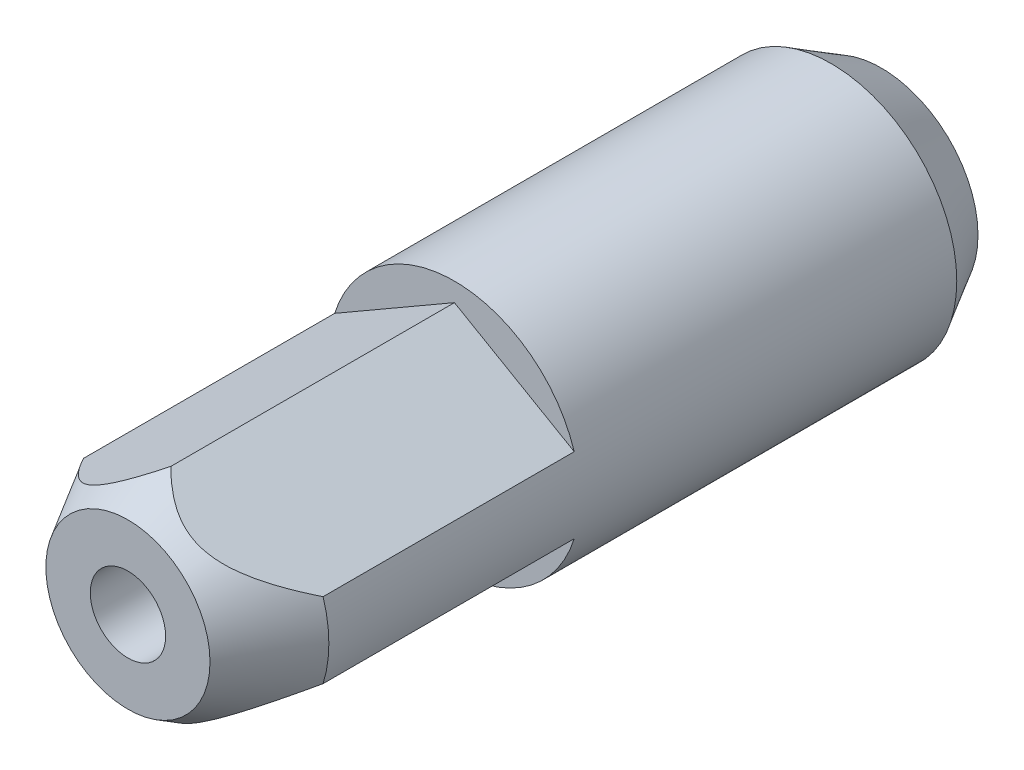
ISO-10303-21;
HEADER;
FILE_DESCRIPTION(('STEP AP214'),'2;1');
FILE_NAME('part.step','',(''),(''),'','','');
FILE_SCHEMA(('AUTOMOTIVE_DESIGN { 1 0 10303 214 1 1 1 1 }'));
ENDSEC;
DATA;
#1=APPLICATION_CONTEXT('core data for automotive mechanical design processes');
#2=APPLICATION_PROTOCOL_DEFINITION('international standard','automotive_design',2000,#1);
#3=PRODUCT_CONTEXT('',#1,'mechanical');
#4=PRODUCT('Part','Part','',(#3));
#5=PRODUCT_RELATED_PRODUCT_CATEGORY('part','',(#4));
#6=PRODUCT_DEFINITION_FORMATION('','',#4);
#7=PRODUCT_DEFINITION_CONTEXT('part definition',#1,'design');
#8=PRODUCT_DEFINITION('design','',#6,#7);
#9=PRODUCT_DEFINITION_SHAPE('','',#8);
#10=(LENGTH_UNIT() NAMED_UNIT(*) SI_UNIT(.MILLI.,.METRE.));
#11=(NAMED_UNIT(*) PLANE_ANGLE_UNIT() SI_UNIT($,.RADIAN.));
#12=(NAMED_UNIT(*) SI_UNIT($,.STERADIAN.) SOLID_ANGLE_UNIT());
#13=UNCERTAINTY_MEASURE_WITH_UNIT(LENGTH_MEASURE(1.E-05),#10,'distance_accuracy_value','');
#14=(GEOMETRIC_REPRESENTATION_CONTEXT(3) GLOBAL_UNCERTAINTY_ASSIGNED_CONTEXT((#13)) GLOBAL_UNIT_ASSIGNED_CONTEXT((#10,
#11,#12)) REPRESENTATION_CONTEXT('',''));
#15=CARTESIAN_POINT('',(0.,0.,0.));
#16=DIRECTION('',(0.,0.,1.));
#17=DIRECTION('',(1.,0.,0.));
#18=AXIS2_PLACEMENT_3D('',#15,#16,#17);
#19=CARTESIAN_POINT('',(0.,0.,27.));
#20=DIRECTION('',(0.,0.,-1.));
#21=DIRECTION('',(-1.,0.,0.));
#22=AXIS2_PLACEMENT_3D('',#19,#20,#21);
#23=CONICAL_SURFACE('',#22,5.,0.523598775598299);
#24=CARTESIAN_POINT('',(0.,0.,30.));
#25=DIRECTION('',(0.,0.,1.));
#26=DIRECTION('',(1.,0.,0.));
#27=AXIS2_PLACEMENT_3D('',#24,#25,#26);
#28=CIRCLE('',#27,3.26794919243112);
#29=CARTESIAN_POINT('',(3.26794919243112,0.,30.));
#30=VERTEX_POINT('',#29);
#31=EDGE_CURVE('E157',#30,#30,#28,.T.);
#32=ORIENTED_EDGE('',*,*,#31,.F.);
#33=EDGE_LOOP('',(#32));
#34=FACE_BOUND('',#33,.T.);
#35=CARTESIAN_POINT('',(-0.000200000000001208,4.2539007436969,28.2922818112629));
#36=CARTESIAN_POINT('',(0.038323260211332,4.23165932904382,28.3308045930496));
#37=CARTESIAN_POINT('',(0.0772314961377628,4.209195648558,28.3688138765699));
#38=CARTESIAN_POINT('',(0.155900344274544,4.16377616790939,28.4436611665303));
#39=CARTESIAN_POINT('',(0.195661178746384,4.14082023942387,28.4804988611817));
#40=CARTESIAN_POINT('',(0.316725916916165,4.07092348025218,28.589376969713));
#41=CARTESIAN_POINT('',(0.399420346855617,4.02317982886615,28.6593859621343));
#42=CARTESIAN_POINT('',(0.57129349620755,3.92394881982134,28.7939882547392));
#43=CARTESIAN_POINT('',(0.660585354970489,3.87239614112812,28.8583915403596));
#44=CARTESIAN_POINT('',(0.843945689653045,3.76653300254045,28.9769188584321));
#45=CARTESIAN_POINT('',(0.938003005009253,3.71222898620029,29.0310656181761));
#46=CARTESIAN_POINT('',(1.13976873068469,3.59573949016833,29.130020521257));
#47=CARTESIAN_POINT('',(1.24795131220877,3.53328024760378,29.1735958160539));
#48=CARTESIAN_POINT('',(1.41329415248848,3.4378195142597,29.2231593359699));
#49=CARTESIAN_POINT('',(1.4687166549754,3.40582131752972,29.237025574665));
#50=CARTESIAN_POINT('',(1.58038760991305,3.34134806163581,29.2591308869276));
#51=CARTESIAN_POINT('',(1.63663566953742,3.30887322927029,29.2673725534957));
#52=CARTESIAN_POINT('',(1.75009913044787,3.24336506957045,29.2779487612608));
#53=CARTESIAN_POINT('',(1.80731862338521,3.21032937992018,29.2802252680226));
#54=CARTESIAN_POINT('',(1.92169033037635,3.14429684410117,29.2786078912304));
#55=CARTESIAN_POINT('',(1.978842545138,3.11129999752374,29.2747140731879));
#56=CARTESIAN_POINT('',(2.09268403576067,3.0455735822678,29.2609098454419));
#57=CARTESIAN_POINT('',(2.14937247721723,3.01284449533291,29.2509903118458));
#58=CARTESIAN_POINT('',(2.26180709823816,2.94793033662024,29.2255298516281));
#59=CARTESIAN_POINT('',(2.31755268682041,2.91574560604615,29.2099855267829));
#60=CARTESIAN_POINT('',(2.51435885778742,2.80211951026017,29.1453717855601));
#61=CARTESIAN_POINT('',(2.65199836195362,2.72265330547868,29.0819760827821));
#62=CARTESIAN_POINT('',(2.8511276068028,2.60768598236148,28.9691954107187));
#63=CARTESIAN_POINT('',(2.91659762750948,2.56988684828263,28.9283995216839));
#64=CARTESIAN_POINT('',(3.04511090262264,2.49568967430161,28.8419756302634));
#65=CARTESIAN_POINT('',(3.10815476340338,2.45929128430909,28.796348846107));
#66=CARTESIAN_POINT('',(3.24864013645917,2.37818201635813,28.6883723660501));
#67=CARTESIAN_POINT('',(3.32538626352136,2.33387261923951,28.6248283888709));
#68=CARTESIAN_POINT('',(3.47569375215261,2.24709255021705,28.4928703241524));
#69=CARTESIAN_POINT('',(3.54925377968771,2.20462264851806,28.4244542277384));
#70=CARTESIAN_POINT('',(3.69378588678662,2.12117699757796,28.28364479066));
#71=CARTESIAN_POINT('',(3.76475040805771,2.08020561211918,28.2112411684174));
#72=CARTESIAN_POINT('',(3.90428118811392,1.99964747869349,28.0634123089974));
#73=CARTESIAN_POINT('',(3.97284718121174,1.96006088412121,27.9879867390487));
#74=CARTESIAN_POINT('',(4.10451079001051,1.88404486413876,27.8385692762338));
#75=CARTESIAN_POINT('',(4.16770996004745,1.84755680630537,27.7646962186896));
#76=CARTESIAN_POINT('',(4.29248993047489,1.77551505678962,27.6151438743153));
#77=CARTESIAN_POINT('',(4.35407061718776,1.73996143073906,27.5394644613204));
#78=CARTESIAN_POINT('',(4.47539394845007,1.66991537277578,27.3871388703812));
#79=CARTESIAN_POINT('',(4.53514639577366,1.63541728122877,27.3105030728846));
#80=CARTESIAN_POINT('',(4.65340823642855,1.5671387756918,27.1559934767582));
#81=CARTESIAN_POINT('',(4.71191791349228,1.53335819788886,27.0781199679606));
#82=CARTESIAN_POINT('',(4.76989600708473,1.49988452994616,26.9997295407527));
#83=B_SPLINE_CURVE_WITH_KNOTS('',3,(#35,#36,#37,#38,#39,#40,#41,#42,#43,#44,#45,#46,#47,#48,#49,
#50,#51,#52,#53,#54,#55,#56,#57,#58,#59,#60,#61,#62,#63,#64,#65,#66,#67,#68,#69,#70,#71,#72,#73,
#74,#75,#76,#77,#78,#79,#80,#81,#82),.UNSPECIFIED.,.F.,.F.,(4,2,2,2,2,2,2,2,2,2,2,2,2,2,2,2,2,2,
2,2,2,2,2,4),(0.,0.176528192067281,0.353102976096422,0.708054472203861,1.07230829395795,
1.4357452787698,1.83100537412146,2.02723914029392,2.22338237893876,2.4214269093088,
2.61946933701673,2.81781238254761,3.01627545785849,3.52623333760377,3.78385768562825,
4.04141722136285,4.36834511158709,4.69540859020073,5.02335892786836,5.3513454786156,
5.66282813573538,5.97433261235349,6.28367121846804,6.59293842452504),.UNSPECIFIED.);
#84=CARTESIAN_POINT('',(0.,4.25378527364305,28.2924818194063));
#85=VERTEX_POINT('',#84);
#86=CARTESIAN_POINT('',(4.76969600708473,1.5,27.));
#87=VERTEX_POINT('',#86);
#88=EDGE_CURVE('E99',#85,#87,#83,.T.);
#89=ORIENTED_EDGE('',*,*,#88,.F.);
#90=CARTESIAN_POINT('',(0.000199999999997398,4.2539007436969,28.2922818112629));
#91=CARTESIAN_POINT('',(-0.0383232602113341,4.23165932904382,28.3308045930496));
#92=CARTESIAN_POINT('',(-0.0772314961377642,4.209195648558,28.3688138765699));
#93=CARTESIAN_POINT('',(-0.155900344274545,4.16377616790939,28.4436611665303));
#94=CARTESIAN_POINT('',(-0.195661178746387,4.14082023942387,28.4804988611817));
#95=CARTESIAN_POINT('',(-0.316725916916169,4.07092348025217,28.589376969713));
#96=CARTESIAN_POINT('',(-0.399420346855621,4.02317982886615,28.6593859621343));
#97=CARTESIAN_POINT('',(-0.571293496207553,3.92394881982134,28.7939882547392));
#98=CARTESIAN_POINT('',(-0.660585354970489,3.87239614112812,28.8583915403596));
#99=CARTESIAN_POINT('',(-0.843945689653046,3.76653300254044,28.9769188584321));
#100=CARTESIAN_POINT('',(-0.938003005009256,3.71222898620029,29.0310656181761));
#101=CARTESIAN_POINT('',(-1.13976873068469,3.59573949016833,29.130020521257));
#102=CARTESIAN_POINT('',(-1.24795131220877,3.53328024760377,29.1735958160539));
#103=CARTESIAN_POINT('',(-1.41329415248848,3.4378195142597,29.2231593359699));
#104=CARTESIAN_POINT('',(-1.4687166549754,3.40582131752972,29.237025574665));
#105=CARTESIAN_POINT('',(-1.58038760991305,3.34134806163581,29.2591308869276));
#106=CARTESIAN_POINT('',(-1.63663566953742,3.30887322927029,29.2673725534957));
#107=CARTESIAN_POINT('',(-1.75009913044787,3.24336506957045,29.2779487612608));
#108=CARTESIAN_POINT('',(-1.80731862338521,3.21032937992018,29.2802252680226));
#109=CARTESIAN_POINT('',(-1.92169033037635,3.14429684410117,29.2786078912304));
#110=CARTESIAN_POINT('',(-1.97884254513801,3.11129999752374,29.2747140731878));
#111=CARTESIAN_POINT('',(-2.09268403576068,3.04557358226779,29.2609098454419));
#112=CARTESIAN_POINT('',(-2.14937247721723,3.01284449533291,29.2509903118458));
#113=CARTESIAN_POINT('',(-2.26180709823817,2.94793033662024,29.2255298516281));
#114=CARTESIAN_POINT('',(-2.31755268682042,2.91574560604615,29.2099855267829));
#115=CARTESIAN_POINT('',(-2.51435885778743,2.80211951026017,29.1453717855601));
#116=CARTESIAN_POINT('',(-2.65199836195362,2.72265330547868,29.0819760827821));
#117=CARTESIAN_POINT('',(-2.8511276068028,2.60768598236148,28.9691954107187));
#118=CARTESIAN_POINT('',(-2.91659762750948,2.56988684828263,28.9283995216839));
#119=CARTESIAN_POINT('',(-3.04511090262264,2.49568967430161,28.8419756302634));
#120=CARTESIAN_POINT('',(-3.10815476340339,2.45929128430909,28.796348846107));
#121=CARTESIAN_POINT('',(-3.24864013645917,2.37818201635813,28.6883723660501));
#122=CARTESIAN_POINT('',(-3.32538626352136,2.33387261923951,28.6248283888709));
#123=CARTESIAN_POINT('',(-3.47569375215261,2.24709255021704,28.4928703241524));
#124=CARTESIAN_POINT('',(-3.54925377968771,2.20462264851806,28.4244542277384));
#125=CARTESIAN_POINT('',(-3.69378588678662,2.12117699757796,28.28364479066));
#126=CARTESIAN_POINT('',(-3.76475040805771,2.08020561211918,28.2112411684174));
#127=CARTESIAN_POINT('',(-3.90428118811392,1.99964747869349,28.0634123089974));
#128=CARTESIAN_POINT('',(-3.97284718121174,1.96006088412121,27.9879867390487));
#129=CARTESIAN_POINT('',(-4.10451079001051,1.88404486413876,27.8385692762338));
#130=CARTESIAN_POINT('',(-4.16770996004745,1.84755680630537,27.7646962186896));
#131=CARTESIAN_POINT('',(-4.29248993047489,1.77551505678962,27.6151438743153));
#132=CARTESIAN_POINT('',(-4.35407061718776,1.73996143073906,27.5394644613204));
#133=CARTESIAN_POINT('',(-4.47539394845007,1.66991537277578,27.3871388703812));
#134=CARTESIAN_POINT('',(-4.53514639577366,1.63541728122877,27.3105030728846));
#135=CARTESIAN_POINT('',(-4.65340823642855,1.5671387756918,27.1559934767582));
#136=CARTESIAN_POINT('',(-4.71191791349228,1.53335819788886,27.0781199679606));
#137=CARTESIAN_POINT('',(-4.76989600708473,1.49988452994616,26.9997295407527));
#138=B_SPLINE_CURVE_WITH_KNOTS('',3,(#90,#91,#92,#93,#94,#95,#96,#97,#98,#99,#100,#101,#102,
#103,#104,#105,#106,#107,#108,#109,#110,#111,#112,#113,#114,#115,#116,#117,#118,#119,#120,#121,
#122,#123,#124,#125,#126,#127,#128,#129,#130,#131,#132,#133,#134,#135,#136,#137),.UNSPECIFIED.,
.F.,.F.,(4,2,2,2,2,2,2,2,2,2,2,2,2,2,2,2,2,2,2,2,2,2,2,4),(0.,0.176528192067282,
0.353102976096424,0.708054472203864,1.07230829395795,1.4357452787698,1.83100537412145,
2.02723914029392,2.22338237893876,2.42142690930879,2.61946933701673,2.81781238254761,
3.0162754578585,3.52623333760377,3.78385768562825,4.04141722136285,4.36834511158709,
4.69540859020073,5.02335892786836,5.3513454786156,5.66282813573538,5.97433261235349,
6.28367121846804,6.59293842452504),.UNSPECIFIED.);
#139=CARTESIAN_POINT('',(-4.76969600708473,1.5,27.));
#140=VERTEX_POINT('',#139);
#141=EDGE_CURVE('E74',#85,#140,#138,.T.);
#142=ORIENTED_EDGE('',*,*,#141,.T.);
#143=CARTESIAN_POINT('',(0.,0.,27.));
#144=DIRECTION('',(0.,0.,1.));
#145=DIRECTION('',(1.,0.,0.));
#146=AXIS2_PLACEMENT_3D('',#143,#144,#145);
#147=CIRCLE('',#146,5.);
#148=CARTESIAN_POINT('',(-4.76969600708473,-1.5,27.));
#149=VERTEX_POINT('',#148);
#150=EDGE_CURVE('E153',#140,#149,#147,.T.);
#151=ORIENTED_EDGE('',*,*,#150,.T.);
#152=CARTESIAN_POINT('',(0.0001999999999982,-4.25390074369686,28.292281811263));
#153=CARTESIAN_POINT('',(-0.0383232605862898,-4.23165932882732,28.3308045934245));
#154=CARTESIAN_POINT('',(-0.0772314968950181,-4.20919564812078,28.3688138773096));
#155=CARTESIAN_POINT('',(-0.155900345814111,-4.16377616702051,28.4436611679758));
#156=CARTESIAN_POINT('',(-0.195661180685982,-4.14082023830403,28.4804988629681));
#157=CARTESIAN_POINT('',(-0.31672592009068,-4.07092347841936,28.5893769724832));
#158=CARTESIAN_POINT('',(-0.399420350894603,-4.02317982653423,28.6593859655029));
#159=CARTESIAN_POINT('',(-0.571293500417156,-3.92394881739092,28.7939882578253));
#160=CARTESIAN_POINT('',(-0.66058535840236,-3.87239613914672,28.858391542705));
#161=CARTESIAN_POINT('',(-0.84394569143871,-3.76653300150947,28.9769188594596));
#162=CARTESIAN_POINT('',(-0.938003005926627,-3.71222898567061,29.0310656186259));
#163=CARTESIAN_POINT('',(-1.13976873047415,-3.59573949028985,29.130020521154));
#164=CARTESIAN_POINT('',(-1.2479513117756,-3.53328024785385,29.1735958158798));
#165=CARTESIAN_POINT('',(-1.41329415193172,-3.43781951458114,29.2231593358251));
#166=CARTESIAN_POINT('',(-1.46871665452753,-3.40582131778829,29.2370255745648));
#167=CARTESIAN_POINT('',(-1.58038760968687,-3.34134806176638,29.2591308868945));
#168=CARTESIAN_POINT('',(-1.63663566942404,-3.30887322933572,29.2673725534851));
#169=CARTESIAN_POINT('',(-1.75009913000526,-3.24336506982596,29.2779487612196));
#170=CARTESIAN_POINT('',(-1.80731862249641,-3.21032938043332,29.2802252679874));
#171=CARTESIAN_POINT('',(-1.92169032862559,-3.14429684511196,29.2786078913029));
#172=CARTESIAN_POINT('',(-1.97884254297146,-3.11129999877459,29.2747140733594));
#173=CARTESIAN_POINT('',(-2.09268403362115,-3.04557358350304,29.2609098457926));
#174=CARTESIAN_POINT('',(-2.1493724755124,-3.01284449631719,29.2509903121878));
#175=CARTESIAN_POINT('',(-2.26180709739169,-2.94793033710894,29.2255298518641));
#176=CARTESIAN_POINT('',(-2.3175526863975,-2.9157456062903,29.2099855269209));
#177=CARTESIAN_POINT('',(-2.51435886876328,-2.80211950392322,29.1453717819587));
#178=CARTESIAN_POINT('',(-2.65199838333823,-2.72265329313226,29.0819760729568));
#179=CARTESIAN_POINT('',(-2.85112763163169,-2.60768596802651,28.9691953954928));
#180=CARTESIAN_POINT('',(-2.9165976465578,-2.56988683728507,28.9283995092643));
#181=CARTESIAN_POINT('',(-3.04511091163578,-2.49568966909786,28.8419756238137));
#182=CARTESIAN_POINT('',(-3.10815476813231,-2.45929128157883,28.7963488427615));
#183=CARTESIAN_POINT('',(-3.24863718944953,-2.37818371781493,28.6883746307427));
#184=CARTESIAN_POINT('',(-3.32538050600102,-2.33387594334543,28.6248331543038));
#185=CARTESIAN_POINT('',(-3.47568259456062,-2.24709899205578,28.4928804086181));
#186=CARTESIAN_POINT('',(-3.54924003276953,-2.20463058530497,28.4244671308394));
#187=CARTESIAN_POINT('',(-3.69376711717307,-2.12118783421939,28.2836635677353));
#188=CARTESIAN_POINT('',(-3.76472920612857,-2.08021785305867,28.2112630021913));
#189=CARTESIAN_POINT('',(-3.90425526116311,-1.99966244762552,28.0634404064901));
#190=CARTESIAN_POINT('',(-3.97281896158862,-1.96007717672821,27.9880180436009));
#191=CARTESIAN_POINT('',(-4.10447837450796,-1.88406357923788,27.8386067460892));
#192=CARTESIAN_POINT('',(-4.16767563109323,-1.84757662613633,27.7647366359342));
#193=CARTESIAN_POINT('',(-4.29245184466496,-1.77553704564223,27.6151902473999));
#194=CARTESIAN_POINT('',(-4.35403068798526,-1.73998448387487,27.5395138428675));
#195=CARTESIAN_POINT('',(-4.47535043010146,-1.66994049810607,27.3871942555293));
#196=CARTESIAN_POINT('',(-4.53510113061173,-1.63544341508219,27.3105614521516));
#197=CARTESIAN_POINT('',(-4.65335952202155,-1.56716690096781,27.156057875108));
#198=CARTESIAN_POINT('',(-4.7118674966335,-1.53338730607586,27.0781873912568));
#199=CARTESIAN_POINT('',(-4.76984390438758,-1.49991461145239,26.9998));
#200=B_SPLINE_CURVE_WITH_KNOTS('',3,(#152,#153,#154,#155,#156,#157,#158,#159,#160,#161,#162,
#163,#164,#165,#166,#167,#168,#169,#170,#171,#172,#173,#174,#175,#176,#177,#178,#179,#180,#181,
#182,#183,#184,#185,#186,#187,#188,#189,#190,#191,#192,#193,#194,#195,#196,#197,#198,#199),
.UNSPECIFIED.,.F.,.F.,(4,2,2,2,2,2,2,2,2,2,2,2,2,2,2,2,2,2,2,2,2,2,2,4),(0.,0.176528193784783,
0.353102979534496,0.708054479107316,1.07230829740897,1.43574527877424,1.83100537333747,
2.02723913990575,2.22338237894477,2.42142690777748,2.61946933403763,2.81781238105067,
3.01627545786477,3.52623337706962,3.78385770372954,4.04141722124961,4.36833285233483,
4.69538405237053,5.02332201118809,5.35129617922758,5.66276788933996,5.97426141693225,
6.28358929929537,6.59284578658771),.UNSPECIFIED.);
#201=CARTESIAN_POINT('',(0.,-4.25378527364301,28.2924818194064));
#202=VERTEX_POINT('',#201);
#203=EDGE_CURVE('E127',#202,#149,#200,.T.);
#204=ORIENTED_EDGE('',*,*,#203,.F.);
#205=CARTESIAN_POINT('',(-0.000200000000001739,-4.25390074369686,28.292281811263));
#206=CARTESIAN_POINT('',(0.0383232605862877,-4.23165932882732,28.3308045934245));
#207=CARTESIAN_POINT('',(0.0772314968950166,-4.20919564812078,28.3688138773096));
#208=CARTESIAN_POINT('',(0.155900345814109,-4.16377616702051,28.4436611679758));
#209=CARTESIAN_POINT('',(0.195661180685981,-4.14082023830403,28.4804988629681));
#210=CARTESIAN_POINT('',(0.316725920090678,-4.07092347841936,28.5893769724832));
#211=CARTESIAN_POINT('',(0.399420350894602,-4.02317982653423,28.6593859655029));
#212=CARTESIAN_POINT('',(0.571293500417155,-3.92394881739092,28.7939882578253));
#213=CARTESIAN_POINT('',(0.660585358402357,-3.87239613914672,28.858391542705));
#214=CARTESIAN_POINT('',(0.843945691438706,-3.76653300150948,28.9769188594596));
#215=CARTESIAN_POINT('',(0.938003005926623,-3.71222898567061,29.0310656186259));
#216=CARTESIAN_POINT('',(1.13976873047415,-3.59573949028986,29.130020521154));
#217=CARTESIAN_POINT('',(1.24795131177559,-3.53328024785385,29.1735958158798));
#218=CARTESIAN_POINT('',(1.41329415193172,-3.43781951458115,29.2231593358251));
#219=CARTESIAN_POINT('',(1.46871665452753,-3.40582131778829,29.2370255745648));
#220=CARTESIAN_POINT('',(1.58038760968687,-3.34134806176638,29.2591308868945));
#221=CARTESIAN_POINT('',(1.63663566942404,-3.30887322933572,29.2673725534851));
#222=CARTESIAN_POINT('',(1.75009913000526,-3.24336506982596,29.2779487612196));
#223=CARTESIAN_POINT('',(1.80731862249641,-3.21032938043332,29.2802252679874));
#224=CARTESIAN_POINT('',(1.92169032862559,-3.14429684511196,29.2786078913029));
#225=CARTESIAN_POINT('',(1.97884254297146,-3.11129999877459,29.2747140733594));
#226=CARTESIAN_POINT('',(2.09268403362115,-3.04557358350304,29.2609098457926));
#227=CARTESIAN_POINT('',(2.1493724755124,-3.01284449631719,29.2509903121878));
#228=CARTESIAN_POINT('',(2.2618070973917,-2.94793033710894,29.2255298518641));
#229=CARTESIAN_POINT('',(2.3175526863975,-2.9157456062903,29.209985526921));
#230=CARTESIAN_POINT('',(2.51435886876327,-2.80211950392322,29.1453717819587));
#231=CARTESIAN_POINT('',(2.65199838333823,-2.72265329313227,29.0819760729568));
#232=CARTESIAN_POINT('',(2.85112763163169,-2.60768596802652,28.9691953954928));
#233=CARTESIAN_POINT('',(2.9165976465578,-2.56988683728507,28.9283995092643));
#234=CARTESIAN_POINT('',(3.04511091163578,-2.49568966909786,28.8419756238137));
#235=CARTESIAN_POINT('',(3.10815476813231,-2.45929128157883,28.7963488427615));
#236=CARTESIAN_POINT('',(3.24863718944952,-2.37818371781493,28.6883746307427));
#237=CARTESIAN_POINT('',(3.32538050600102,-2.33387594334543,28.6248331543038));
#238=CARTESIAN_POINT('',(3.47568259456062,-2.24709899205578,28.4928804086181));
#239=CARTESIAN_POINT('',(3.54924003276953,-2.20463058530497,28.4244671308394));
#240=CARTESIAN_POINT('',(3.69376711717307,-2.12118783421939,28.2836635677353));
#241=CARTESIAN_POINT('',(3.76472920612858,-2.08021785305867,28.2112630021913));
#242=CARTESIAN_POINT('',(3.90425526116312,-1.99966244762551,28.0634404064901));
#243=CARTESIAN_POINT('',(3.97281896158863,-1.96007717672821,27.9880180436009));
#244=CARTESIAN_POINT('',(4.10447837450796,-1.88406357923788,27.8386067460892));
#245=CARTESIAN_POINT('',(4.16767563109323,-1.84757662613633,27.7647366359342));
#246=CARTESIAN_POINT('',(4.29245184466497,-1.77553704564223,27.6151902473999));
#247=CARTESIAN_POINT('',(4.35403068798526,-1.73998448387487,27.5395138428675));
#248=CARTESIAN_POINT('',(4.47535043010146,-1.66994049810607,27.3871942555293));
#249=CARTESIAN_POINT('',(4.53510113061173,-1.63544341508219,27.3105614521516));
#250=CARTESIAN_POINT('',(4.65335952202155,-1.56716690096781,27.156057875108));
#251=CARTESIAN_POINT('',(4.7118674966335,-1.53338730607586,27.0781873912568));
#252=CARTESIAN_POINT('',(4.76984390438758,-1.49991461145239,26.9998));
#253=B_SPLINE_CURVE_WITH_KNOTS('',3,(#205,#206,#207,#208,#209,#210,#211,#212,#213,#214,#215,
#216,#217,#218,#219,#220,#221,#222,#223,#224,#225,#226,#227,#228,#229,#230,#231,#232,#233,#234,
#235,#236,#237,#238,#239,#240,#241,#242,#243,#244,#245,#246,#247,#248,#249,#250,#251,#252),
.UNSPECIFIED.,.F.,.F.,(4,2,2,2,2,2,2,2,2,2,2,2,2,2,2,2,2,2,2,2,2,2,2,4),(0.,0.176528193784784,
0.353102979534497,0.708054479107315,1.07230829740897,1.43574527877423,1.83100537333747,
2.02723913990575,2.22338237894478,2.42142690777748,2.61946933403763,2.81781238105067,
3.01627545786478,3.52623337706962,3.78385770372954,4.04141722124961,4.36833285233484,
4.69538405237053,5.0233220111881,5.35129617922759,5.66276788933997,5.97426141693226,
6.28358929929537,6.59284578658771),.UNSPECIFIED.);
#254=CARTESIAN_POINT('',(4.76969600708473,-1.5,27.));
#255=VERTEX_POINT('',#254);
#256=EDGE_CURVE('E136',#202,#255,#253,.T.);
#257=ORIENTED_EDGE('',*,*,#256,.T.);
#258=EDGE_CURVE('E154',#255,#87,#147,.T.);
#259=ORIENTED_EDGE('',*,*,#258,.T.);
#260=EDGE_LOOP('',(#89,#142,#151,#204,#257,#259));
#261=FACE_BOUND('',#260,.T.);
#262=ADVANCED_FACE('F14',(#34,#261),#23,.T.);
#263=CARTESIAN_POINT('',(0.,0.,30.));
#264=DIRECTION('',(0.,0.,1.));
#265=DIRECTION('',(1.,0.,0.));
#266=AXIS2_PLACEMENT_3D('',#263,#264,#265);
#267=CYLINDRICAL_SURFACE('',#266,5.);
#268=CARTESIAN_POINT('',(0.,0.,2.));
#269=DIRECTION('',(0.,0.,1.));
#270=DIRECTION('',(1.,0.,0.));
#271=AXIS2_PLACEMENT_3D('',#268,#269,#270);
#272=CIRCLE('',#271,5.);
#273=CARTESIAN_POINT('',(5.,0.,2.));
#274=VERTEX_POINT('',#273);
#275=EDGE_CURVE('E150',#274,#274,#272,.T.);
#276=ORIENTED_EDGE('',*,*,#275,.T.);
#277=EDGE_LOOP('',(#276));
#278=FACE_BOUND('',#277,.T.);
#279=DIRECTION('',(0.,0.,1.));
#280=VECTOR('',#279,1.);
#281=CARTESIAN_POINT('',(4.76969600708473,1.5,17.));
#282=LINE('',#281,#280);
#283=CARTESIAN_POINT('',(4.76969600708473,1.5,17.));
#284=VERTEX_POINT('',#283);
#285=EDGE_CURVE('E81',#284,#87,#282,.T.);
#286=ORIENTED_EDGE('',*,*,#285,.T.);
#287=ORIENTED_EDGE('',*,*,#258,.F.);
#288=DIRECTION('',(0.,0.,1.));
#289=VECTOR('',#288,1.);
#290=CARTESIAN_POINT('',(4.76969600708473,-1.5,17.));
#291=LINE('',#290,#289);
#292=CARTESIAN_POINT('',(4.76969600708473,-1.5,17.));
#293=VERTEX_POINT('',#292);
#294=EDGE_CURVE('E186',#293,#255,#291,.T.);
#295=ORIENTED_EDGE('',*,*,#294,.F.);
#296=CARTESIAN_POINT('',(0.,0.,17.));
#297=DIRECTION('',(0.,0.,1.));
#298=DIRECTION('',(1.,0.,0.));
#299=AXIS2_PLACEMENT_3D('',#296,#297,#298);
#300=CIRCLE('',#299,5.);
#301=CARTESIAN_POINT('',(-4.76969600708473,-1.5,17.));
#302=VERTEX_POINT('',#301);
#303=EDGE_CURVE('E176',#302,#293,#300,.T.);
#304=ORIENTED_EDGE('',*,*,#303,.F.);
#305=DIRECTION('',(0.,0.,1.));
#306=VECTOR('',#305,1.);
#307=CARTESIAN_POINT('',(-4.76969600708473,-1.5,17.));
#308=LINE('',#307,#306);
#309=EDGE_CURVE('E183',#302,#149,#308,.T.);
#310=ORIENTED_EDGE('',*,*,#309,.T.);
#311=ORIENTED_EDGE('',*,*,#150,.F.);
#312=DIRECTION('',(0.,0.,1.));
#313=VECTOR('',#312,1.);
#314=CARTESIAN_POINT('',(-4.76969600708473,1.5,17.));
#315=LINE('',#314,#313);
#316=CARTESIAN_POINT('',(-4.76969600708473,1.5,17.));
#317=VERTEX_POINT('',#316);
#318=EDGE_CURVE('E77',#317,#140,#315,.T.);
#319=ORIENTED_EDGE('',*,*,#318,.F.);
#320=CARTESIAN_POINT('',(0.,0.,17.));
#321=DIRECTION('',(0.,0.,1.));
#322=DIRECTION('',(1.,0.,0.));
#323=AXIS2_PLACEMENT_3D('',#320,#321,#322);
#324=CIRCLE('',#323,5.);
#325=EDGE_CURVE('E85',#284,#317,#324,.T.);
#326=ORIENTED_EDGE('',*,*,#325,.F.);
#327=EDGE_LOOP('',(#286,#287,#295,#304,#310,#311,#319,#326));
#328=FACE_BOUND('',#327,.T.);
#329=ADVANCED_FACE('F172',(#278,#328),#267,.T.);
#330=CARTESIAN_POINT('',(0.,0.,22.));
#331=DIRECTION('',(0.,0.,1.));
#332=DIRECTION('',(1.,0.,0.));
#333=AXIS2_PLACEMENT_3D('',#330,#331,#332);
#334=PLANE('',#333);
#335=CARTESIAN_POINT('',(0.,0.,22.));
#336=DIRECTION('',(0.,0.,1.));
#337=DIRECTION('',(1.,0.,0.));
#338=AXIS2_PLACEMENT_3D('',#335,#336,#337);
#339=CIRCLE('',#338,1.5);
#340=CARTESIAN_POINT('',(1.5,0.,22.));
#341=VERTEX_POINT('',#340);
#342=EDGE_CURVE('E9',#341,#341,#339,.T.);
#343=ORIENTED_EDGE('',*,*,#342,.T.);
#344=EDGE_LOOP('',(#343));
#345=FACE_BOUND('',#344,.T.);
#346=ADVANCED_FACE('F16',(#345),#334,.T.);
#347=CARTESIAN_POINT('',(0.,0.,30.));
#348=DIRECTION('',(0.,0.,1.));
#349=DIRECTION('',(1.,0.,0.));
#350=AXIS2_PLACEMENT_3D('',#347,#348,#349);
#351=CYLINDRICAL_SURFACE('',#350,1.5);
#352=ORIENTED_EDGE('',*,*,#342,.F.);
#353=EDGE_LOOP('',(#352));
#354=FACE_BOUND('',#353,.T.);
#355=CARTESIAN_POINT('',(0.,0.,30.));
#356=DIRECTION('',(0.,0.,1.));
#357=DIRECTION('',(1.,0.,0.));
#358=AXIS2_PLACEMENT_3D('',#355,#356,#357);
#359=CIRCLE('',#358,1.5);
#360=CARTESIAN_POINT('',(1.5,0.,30.));
#361=VERTEX_POINT('',#360);
#362=EDGE_CURVE('E22',#361,#361,#359,.T.);
#363=ORIENTED_EDGE('',*,*,#362,.T.);
#364=EDGE_LOOP('',(#363));
#365=FACE_BOUND('',#364,.T.);
#366=ADVANCED_FACE('F162',(#354,#365),#351,.F.);
#367=CARTESIAN_POINT('',(3.26794919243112,0.,30.));
#368=DIRECTION('',(0.,0.,-1.));
#369=DIRECTION('',(-1.,0.,0.));
#370=AXIS2_PLACEMENT_3D('',#367,#368,#369);
#371=PLANE('',#370);
#372=ORIENTED_EDGE('',*,*,#362,.F.);
#373=EDGE_LOOP('',(#372));
#374=FACE_BOUND('',#373,.T.);
#375=ORIENTED_EDGE('',*,*,#31,.T.);
#376=EDGE_LOOP('',(#375));
#377=FACE_BOUND('',#376,.T.);
#378=ADVANCED_FACE('F164',(#374,#377),#371,.F.);
#379=CARTESIAN_POINT('',(0.,0.,0.));
#380=DIRECTION('',(0.,0.,1.));
#381=DIRECTION('',(1.,0.,0.));
#382=AXIS2_PLACEMENT_3D('',#379,#380,#381);
#383=CONICAL_SURFACE('',#382,3.84529946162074,0.523598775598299);
#384=ORIENTED_EDGE('',*,*,#275,.F.);
#385=EDGE_LOOP('',(#384));
#386=FACE_BOUND('',#385,.T.);
#387=CARTESIAN_POINT('',(0.,0.,0.));
#388=DIRECTION('',(0.,0.,1.));
#389=DIRECTION('',(1.,0.,0.));
#390=AXIS2_PLACEMENT_3D('',#387,#388,#389);
#391=CIRCLE('',#390,3.84529946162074);
#392=CARTESIAN_POINT('',(3.84529946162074,0.,0.));
#393=VERTEX_POINT('',#392);
#394=EDGE_CURVE('E147',#393,#393,#391,.T.);
#395=ORIENTED_EDGE('',*,*,#394,.T.);
#396=EDGE_LOOP('',(#395));
#397=FACE_BOUND('',#396,.T.);
#398=ADVANCED_FACE('F167',(#386,#397),#383,.T.);
#399=CARTESIAN_POINT('',(1.,0.,0.));
#400=DIRECTION('',(0.,0.,1.));
#401=DIRECTION('',(1.,0.,0.));
#402=AXIS2_PLACEMENT_3D('',#399,#400,#401);
#403=PLANE('',#402);
#404=ORIENTED_EDGE('',*,*,#394,.F.);
#405=EDGE_LOOP('',(#404));
#406=FACE_BOUND('',#405,.T.);
#407=CARTESIAN_POINT('',(0.,0.,0.));
#408=DIRECTION('',(0.,0.,1.));
#409=DIRECTION('',(1.,0.,0.));
#410=AXIS2_PLACEMENT_3D('',#407,#408,#409);
#411=CIRCLE('',#410,1.);
#412=CARTESIAN_POINT('',(1.,0.,0.));
#413=VERTEX_POINT('',#412);
#414=EDGE_CURVE('E144',#413,#413,#411,.T.);
#415=ORIENTED_EDGE('',*,*,#414,.T.);
#416=EDGE_LOOP('',(#415));
#417=FACE_BOUND('',#416,.T.);
#418=ADVANCED_FACE('F247',(#406,#417),#403,.F.);
#419=CARTESIAN_POINT('',(0.,0.,30.));
#420=DIRECTION('',(0.,0.,1.));
#421=DIRECTION('',(1.,0.,0.));
#422=AXIS2_PLACEMENT_3D('',#419,#420,#421);
#423=CYLINDRICAL_SURFACE('',#422,1.);
#424=ORIENTED_EDGE('',*,*,#414,.F.);
#425=EDGE_LOOP('',(#424));
#426=FACE_BOUND('',#425,.T.);
#427=CARTESIAN_POINT('',(0.,0.,4.));
#428=DIRECTION('',(0.,0.,1.));
#429=DIRECTION('',(1.,0.,0.));
#430=AXIS2_PLACEMENT_3D('',#427,#428,#429);
#431=CIRCLE('',#430,1.);
#432=CARTESIAN_POINT('',(1.,0.,4.));
#433=VERTEX_POINT('',#432);
#434=EDGE_CURVE('E135',#433,#433,#431,.T.);
#435=ORIENTED_EDGE('',*,*,#434,.T.);
#436=EDGE_LOOP('',(#435));
#437=FACE_BOUND('',#436,.T.);
#438=ADVANCED_FACE('F237',(#426,#437),#423,.F.);
#439=CARTESIAN_POINT('',(0.,0.,4.));
#440=DIRECTION('',(0.,0.,1.));
#441=DIRECTION('',(1.,0.,0.));
#442=AXIS2_PLACEMENT_3D('',#439,#440,#441);
#443=PLANE('',#442);
#444=ORIENTED_EDGE('',*,*,#434,.F.);
#445=EDGE_LOOP('',(#444));
#446=FACE_BOUND('',#445,.T.);
#447=ADVANCED_FACE('F122',(#446),#443,.F.);
#448=CARTESIAN_POINT('',(-4.76969600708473,-1.5,17.));
#449=DIRECTION('',(-0.5,-0.866025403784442,0.));
#450=DIRECTION('',(0.866025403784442,-0.5,0.));
#451=AXIS2_PLACEMENT_3D('',#448,#449,#450);
#452=PLANE('',#451);
#453=ORIENTED_EDGE('',*,*,#203,.T.);
#454=ORIENTED_EDGE('',*,*,#309,.F.);
#455=DIRECTION('',(0.866025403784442,-0.5,0.));
#456=VECTOR('',#455,1.);
#457=CARTESIAN_POINT('',(-4.76969600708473,-1.5,17.));
#458=LINE('',#457,#456);
#459=CARTESIAN_POINT('',(0.,-4.25378527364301,17.));
#460=VERTEX_POINT('',#459);
#461=EDGE_CURVE('E37',#302,#460,#458,.T.);
#462=ORIENTED_EDGE('',*,*,#461,.T.);
#463=DIRECTION('',(0.,0.,1.));
#464=VECTOR('',#463,1.);
#465=CARTESIAN_POINT('',(0.,-4.25378527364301,17.));
#466=LINE('',#465,#464);
#467=EDGE_CURVE('E187',#460,#202,#466,.T.);
#468=ORIENTED_EDGE('',*,*,#467,.T.);
#469=EDGE_LOOP('',(#453,#454,#462,#468));
#470=FACE_BOUND('',#469,.T.);
#471=ADVANCED_FACE('F118',(#470),#452,.T.);
#472=CARTESIAN_POINT('',(4.76969600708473,-1.5,17.));
#473=DIRECTION('',(-0.5,0.866025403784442,0.));
#474=DIRECTION('',(-0.866025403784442,-0.5,0.));
#475=AXIS2_PLACEMENT_3D('',#472,#473,#474);
#476=PLANE('',#475);
#477=ORIENTED_EDGE('',*,*,#467,.F.);
#478=DIRECTION('',(-0.866025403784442,-0.5,0.));
#479=VECTOR('',#478,1.);
#480=CARTESIAN_POINT('',(4.76969600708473,-1.5,17.));
#481=LINE('',#480,#479);
#482=EDGE_CURVE('E177',#293,#460,#481,.T.);
#483=ORIENTED_EDGE('',*,*,#482,.F.);
#484=ORIENTED_EDGE('',*,*,#294,.T.);
#485=ORIENTED_EDGE('',*,*,#256,.F.);
#486=EDGE_LOOP('',(#477,#483,#484,#485));
#487=FACE_BOUND('',#486,.T.);
#488=ADVANCED_FACE('F117',(#487),#476,.F.);
#489=CARTESIAN_POINT('',(0.,0.,17.));
#490=DIRECTION('',(0.,0.,1.));
#491=DIRECTION('',(1.,0.,0.));
#492=AXIS2_PLACEMENT_3D('',#489,#490,#491);
#493=PLANE('',#492);
#494=ORIENTED_EDGE('',*,*,#461,.F.);
#495=ORIENTED_EDGE('',*,*,#303,.T.);
#496=ORIENTED_EDGE('',*,*,#482,.T.);
#497=EDGE_LOOP('',(#494,#495,#496));
#498=FACE_BOUND('',#497,.T.);
#499=ADVANCED_FACE('F114',(#498),#493,.T.);
#500=CARTESIAN_POINT('',(4.76969600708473,1.5,17.));
#501=DIRECTION('',(0.5,0.866025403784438,0.));
#502=DIRECTION('',(-0.866025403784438,0.5,0.));
#503=AXIS2_PLACEMENT_3D('',#500,#501,#502);
#504=PLANE('',#503);
#505=ORIENTED_EDGE('',*,*,#88,.T.);
#506=ORIENTED_EDGE('',*,*,#285,.F.);
#507=DIRECTION('',(-0.866025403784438,0.5,0.));
#508=VECTOR('',#507,1.);
#509=CARTESIAN_POINT('',(4.76969600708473,1.5,17.));
#510=LINE('',#509,#508);
#511=CARTESIAN_POINT('',(0.,4.25378527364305,17.));
#512=VERTEX_POINT('',#511);
#513=EDGE_CURVE('E29',#284,#512,#510,.T.);
#514=ORIENTED_EDGE('',*,*,#513,.T.);
#515=DIRECTION('',(0.,0.,1.));
#516=VECTOR('',#515,1.);
#517=CARTESIAN_POINT('',(0.,4.25378527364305,17.));
#518=LINE('',#517,#516);
#519=EDGE_CURVE('E70',#512,#85,#518,.T.);
#520=ORIENTED_EDGE('',*,*,#519,.T.);
#521=EDGE_LOOP('',(#505,#506,#514,#520));
#522=FACE_BOUND('',#521,.T.);
#523=ADVANCED_FACE('F79',(#522),#504,.T.);
#524=CARTESIAN_POINT('',(-4.76969600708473,1.5,17.));
#525=DIRECTION('',(0.5,-0.866025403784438,0.));
#526=DIRECTION('',(0.866025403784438,0.5,0.));
#527=AXIS2_PLACEMENT_3D('',#524,#525,#526);
#528=PLANE('',#527);
#529=ORIENTED_EDGE('',*,*,#519,.F.);
#530=DIRECTION('',(0.866025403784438,0.5,0.));
#531=VECTOR('',#530,1.);
#532=CARTESIAN_POINT('',(-4.76969600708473,1.5,17.));
#533=LINE('',#532,#531);
#534=EDGE_CURVE('E72',#317,#512,#533,.T.);
#535=ORIENTED_EDGE('',*,*,#534,.F.);
#536=ORIENTED_EDGE('',*,*,#318,.T.);
#537=ORIENTED_EDGE('',*,*,#141,.F.);
#538=EDGE_LOOP('',(#529,#535,#536,#537));
#539=FACE_BOUND('',#538,.T.);
#540=ADVANCED_FACE('F71',(#539),#528,.F.);
#541=CARTESIAN_POINT('',(0.,0.,17.));
#542=DIRECTION('',(0.,0.,1.));
#543=DIRECTION('',(1.,0.,0.));
#544=AXIS2_PLACEMENT_3D('',#541,#542,#543);
#545=PLANE('',#544);
#546=ORIENTED_EDGE('',*,*,#513,.F.);
#547=ORIENTED_EDGE('',*,*,#325,.T.);
#548=ORIENTED_EDGE('',*,*,#534,.T.);
#549=EDGE_LOOP('',(#546,#547,#548));
#550=FACE_BOUND('',#549,.T.);
#551=ADVANCED_FACE('F84',(#550),#545,.T.);
#552=CLOSED_SHELL('',(#262,#329,#346,#366,#378,#398,#418,#438,#447,#471,#488,#499,#523,#540,#551));
#553=MANIFOLD_SOLID_BREP('B1',#552);
#554=ADVANCED_BREP_SHAPE_REPRESENTATION('',(#18,#553),#14);
#555=SHAPE_DEFINITION_REPRESENTATION(#9,#554);
ENDSEC;
END-ISO-10303-21;
